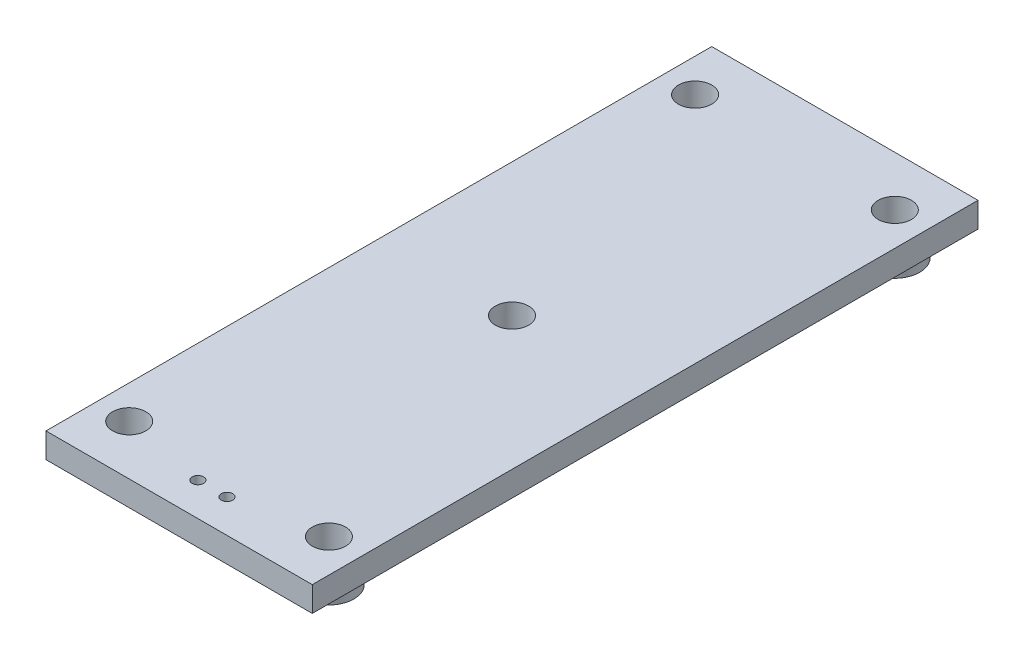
from build123d import *

# Parameters (mm, degrees)
SKETCH1_W           = 203.2
SKETCH1_H           = 508
BASE_EXTRUDE_DEPTH  = 19.05
SKETCH2_R           = 19.05
BOSS_EXTRUDE1_DEPTH = 12.7
SKETCH3_R           = 12.7
CUT_EXTRUDE1_DEPTH  = 520.032390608
SKETCH4_R           = 12.7
CUT_EXTRUDE2_DEPTH  = 520.032390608
SKETCH5_R           = 4.365625
CUT_EXTRUDE3_DEPTH  = 519.410515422


with BuildPart() as part:
    # Sketch1 → Base-Extrude (new body)
    with BuildSketch(Plane(origin=(0, 0, 0), x_dir=(1, 0, 0), z_dir=(0, 1, 0))):
        with Locations((0, -254)):
            Rectangle(SKETCH1_W, SKETCH1_H)
    extrude(amount=BASE_EXTRUDE_DEPTH)

    # Sketch2 → Boss-Extrude1 (add)
    with BuildSketch(Plane.XZ):
        with Locations(Location((76.2, 469.9, 0), (0, 0, 270))):
            Circle(SKETCH2_R)
        with Locations(Location((76.2, 38.1, 0), (0, 0, 90))):
            Circle(SKETCH2_R)
        with Locations(Location((-76.2, 38.1, 0), (0, 0, 270))):
            Circle(SKETCH2_R)
        with Locations(Location((-76.2, 469.9, 0), (0, 0, 90))):
            Circle(SKETCH2_R)
    extrude(amount=BOSS_EXTRUDE1_DEPTH)

    # Sketch3 → Cut-Extrude1 (cut, through all)
    with BuildSketch(Plane.XZ.offset(12.7)):
        with Locations(Location((76.2, 469.9, 0), (0, 0, 270))):
            Circle(SKETCH3_R)
        with Locations(Location((-76.2, 469.9, 0), (0, 0, 270))):
            Circle(SKETCH3_R)
        with Locations(Location((76.2, 38.1, 0), (0, 0, 270))):
            Circle(SKETCH3_R)
        with Locations(Location((-76.2, 38.1, 0), (0, 0, 270))):
            Circle(SKETCH3_R)
    extrude(amount=-CUT_EXTRUDE1_DEPTH, mode=Mode.SUBTRACT)

    # Sketch4 → Cut-Extrude2 (cut, through all)
    with BuildSketch(Plane(origin=(0, 19.05, 0), x_dir=(-1, 0, 0), z_dir=(0, 1, 0))):
        with Locations(Location((0, 254, 0), (0, 0, 90))):
            Circle(SKETCH4_R)
    extrude(amount=-CUT_EXTRUDE2_DEPTH, mode=Mode.SUBTRACT)

    # Sketch5 → Cut-Extrude3 (cut, through all)
    with BuildSketch(Plane.XZ):
        with Locations(Location((11.1125, 482.6, 0), (0, 0, 270))):
            Circle(SKETCH5_R)
        with Locations(Location((-11.1125, 482.6, 0), (0, 0, 270))):
            Circle(SKETCH5_R)
    extrude(amount=-CUT_EXTRUDE3_DEPTH, mode=Mode.SUBTRACT)


solid = part.part
